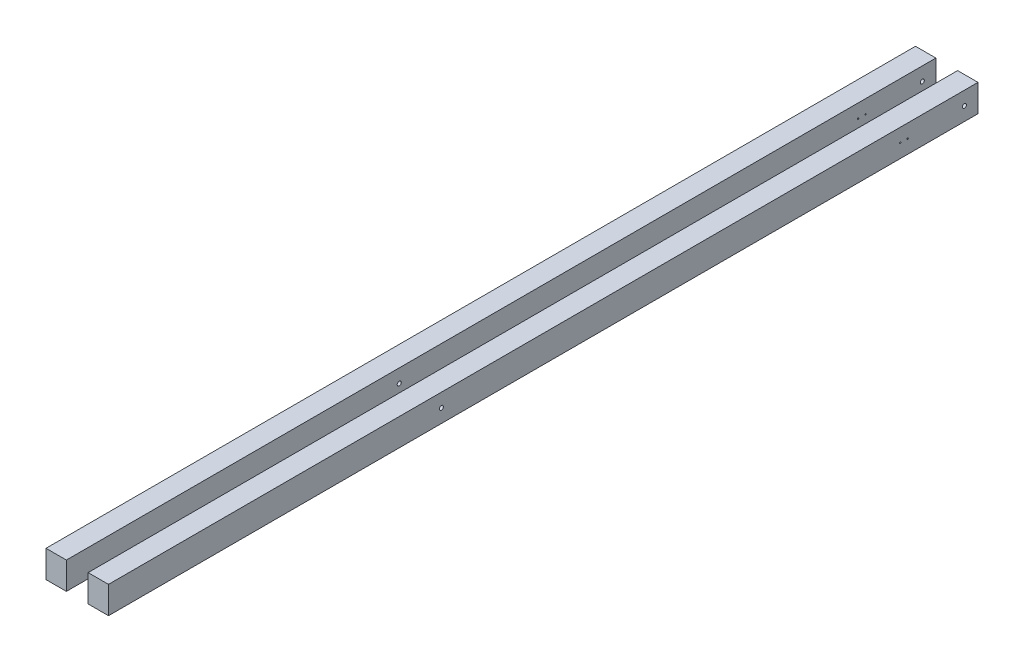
ISO-10303-21;
HEADER;
FILE_DESCRIPTION(('STEP AP214'),'2;1');
FILE_NAME('part.step','',(''),(''),'','','');
FILE_SCHEMA(('AUTOMOTIVE_DESIGN { 1 0 10303 214 1 1 1 1 }'));
ENDSEC;
DATA;
#1=APPLICATION_CONTEXT('core data for automotive mechanical design processes');
#2=APPLICATION_PROTOCOL_DEFINITION('international standard','automotive_design',2000,#1);
#3=PRODUCT_CONTEXT('',#1,'mechanical');
#4=PRODUCT('Part','Part','',(#3));
#5=PRODUCT_RELATED_PRODUCT_CATEGORY('part','',(#4));
#6=PRODUCT_DEFINITION_FORMATION('','',#4);
#7=PRODUCT_DEFINITION_CONTEXT('part definition',#1,'design');
#8=PRODUCT_DEFINITION('design','',#6,#7);
#9=PRODUCT_DEFINITION_SHAPE('','',#8);
#10=(LENGTH_UNIT() NAMED_UNIT(*) SI_UNIT(.MILLI.,.METRE.));
#11=(NAMED_UNIT(*) PLANE_ANGLE_UNIT() SI_UNIT($,.RADIAN.));
#12=(NAMED_UNIT(*) SI_UNIT($,.STERADIAN.) SOLID_ANGLE_UNIT());
#13=UNCERTAINTY_MEASURE_WITH_UNIT(LENGTH_MEASURE(1.E-05),#10,'distance_accuracy_value','');
#14=(GEOMETRIC_REPRESENTATION_CONTEXT(3) GLOBAL_UNCERTAINTY_ASSIGNED_CONTEXT((#13)) GLOBAL_UNIT_ASSIGNED_CONTEXT((#10,
#11,#12)) REPRESENTATION_CONTEXT('',''));
#15=CARTESIAN_POINT('',(0.,0.,0.));
#16=DIRECTION('',(0.,0.,1.));
#17=DIRECTION('',(1.,0.,0.));
#18=AXIS2_PLACEMENT_3D('',#15,#16,#17);
#19=CARTESIAN_POINT('',(16.,-20.,1280.));
#20=DIRECTION('',(1.,0.,0.));
#21=DIRECTION('',(0.,0.,-1.));
#22=AXIS2_PLACEMENT_3D('',#19,#20,#21);
#23=PLANE('',#22);
#24=CARTESIAN_POINT('',(16.,0.,790.));
#25=DIRECTION('',(1.,0.,0.));
#26=DIRECTION('',(0.,0.,-1.));
#27=AXIS2_PLACEMENT_3D('',#24,#25,#26);
#28=CIRCLE('',#27,3.00000000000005);
#29=CARTESIAN_POINT('',(16.,0.,787.));
#30=VERTEX_POINT('',#29);
#31=EDGE_CURVE('E109',#30,#30,#28,.T.);
#32=ORIENTED_EDGE('',*,*,#31,.T.);
#33=EDGE_LOOP('',(#32));
#34=FACE_BOUND('',#33,.T.);
#35=CARTESIAN_POINT('',(16.,0.,20.));
#36=DIRECTION('',(1.,0.,0.));
#37=DIRECTION('',(0.,0.,-1.));
#38=AXIS2_PLACEMENT_3D('',#35,#36,#37);
#39=CIRCLE('',#38,3.);
#40=CARTESIAN_POINT('',(16.,0.,17.));
#41=VERTEX_POINT('',#40);
#42=EDGE_CURVE('E122',#41,#41,#39,.T.);
#43=ORIENTED_EDGE('',*,*,#42,.T.);
#44=EDGE_LOOP('',(#43));
#45=FACE_BOUND('',#44,.T.);
#46=CARTESIAN_POINT('',(16.,0.,114.397647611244));
#47=DIRECTION('',(1.,0.,0.));
#48=DIRECTION('',(0.,0.,-1.));
#49=AXIS2_PLACEMENT_3D('',#46,#47,#48);
#50=CIRCLE('',#49,0.999999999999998);
#51=CARTESIAN_POINT('',(16.,0.,113.397647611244));
#52=VERTEX_POINT('',#51);
#53=EDGE_CURVE('E125',#52,#52,#50,.T.);
#54=ORIENTED_EDGE('',*,*,#53,.T.);
#55=EDGE_LOOP('',(#54));
#56=FACE_BOUND('',#55,.T.);
#57=CARTESIAN_POINT('',(16.,0.,103.592173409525));
#58=DIRECTION('',(1.,0.,0.));
#59=DIRECTION('',(0.,0.,-1.));
#60=AXIS2_PLACEMENT_3D('',#57,#58,#59);
#61=CIRCLE('',#60,0.999999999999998);
#62=CARTESIAN_POINT('',(16.,0.,102.592173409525));
#63=VERTEX_POINT('',#62);
#64=EDGE_CURVE('E128',#63,#63,#61,.T.);
#65=ORIENTED_EDGE('',*,*,#64,.T.);
#66=EDGE_LOOP('',(#65));
#67=FACE_BOUND('',#66,.T.);
#68=DIRECTION('',(0.,-1.,0.));
#69=VECTOR('',#68,1.);
#70=CARTESIAN_POINT('',(16.,-20.,0.));
#71=LINE('',#70,#69);
#72=CARTESIAN_POINT('',(16.,20.,0.));
#73=VERTEX_POINT('',#72);
#74=CARTESIAN_POINT('',(16.,-20.,0.));
#75=VERTEX_POINT('',#74);
#76=EDGE_CURVE('E106',#73,#75,#71,.T.);
#77=ORIENTED_EDGE('',*,*,#76,.T.);
#78=DIRECTION('',(0.,0.,-1.));
#79=VECTOR('',#78,1.);
#80=CARTESIAN_POINT('',(16.,-20.,1280.));
#81=LINE('',#80,#79);
#82=CARTESIAN_POINT('',(16.,-20.,1280.));
#83=VERTEX_POINT('',#82);
#84=EDGE_CURVE('E12',#83,#75,#81,.T.);
#85=ORIENTED_EDGE('',*,*,#84,.F.);
#86=DIRECTION('',(0.,-1.,0.));
#87=VECTOR('',#86,1.);
#88=CARTESIAN_POINT('',(16.,-20.,1280.));
#89=LINE('',#88,#87);
#90=CARTESIAN_POINT('',(16.,20.,1280.));
#91=VERTEX_POINT('',#90);
#92=EDGE_CURVE('E94',#91,#83,#89,.T.);
#93=ORIENTED_EDGE('',*,*,#92,.F.);
#94=DIRECTION('',(0.,0.,-1.));
#95=VECTOR('',#94,1.);
#96=CARTESIAN_POINT('',(16.,20.,1280.));
#97=LINE('',#96,#95);
#98=EDGE_CURVE('E102',#91,#73,#97,.T.);
#99=ORIENTED_EDGE('',*,*,#98,.T.);
#100=EDGE_LOOP('',(#77,#85,#93,#99));
#101=FACE_BOUND('',#100,.T.);
#102=ADVANCED_FACE('F43',(#34,#45,#56,#67,#101),#23,.F.);
#103=CARTESIAN_POINT('',(46.,-20.,1280.));
#104=DIRECTION('',(0.,1.,0.));
#105=DIRECTION('',(-1.,0.,0.));
#106=AXIS2_PLACEMENT_3D('',#103,#104,#105);
#107=PLANE('',#106);
#108=DIRECTION('',(1.,0.,0.));
#109=VECTOR('',#108,1.);
#110=CARTESIAN_POINT('',(46.,-20.,0.));
#111=LINE('',#110,#109);
#112=CARTESIAN_POINT('',(46.,-20.,0.));
#113=VERTEX_POINT('',#112);
#114=EDGE_CURVE('E98',#75,#113,#111,.T.);
#115=ORIENTED_EDGE('',*,*,#114,.T.);
#116=DIRECTION('',(0.,0.,-1.));
#117=VECTOR('',#116,1.);
#118=CARTESIAN_POINT('',(46.,-20.,1280.));
#119=LINE('',#118,#117);
#120=CARTESIAN_POINT('',(46.,-20.,1280.));
#121=VERTEX_POINT('',#120);
#122=EDGE_CURVE('E51',#121,#113,#119,.T.);
#123=ORIENTED_EDGE('',*,*,#122,.F.);
#124=DIRECTION('',(1.,0.,0.));
#125=VECTOR('',#124,1.);
#126=CARTESIAN_POINT('',(46.,-20.,1280.));
#127=LINE('',#126,#125);
#128=EDGE_CURVE('E89',#83,#121,#127,.T.);
#129=ORIENTED_EDGE('',*,*,#128,.F.);
#130=ORIENTED_EDGE('',*,*,#84,.T.);
#131=EDGE_LOOP('',(#115,#123,#129,#130));
#132=FACE_BOUND('',#131,.T.);
#133=ADVANCED_FACE('F97',(#132),#107,.F.);
#134=CARTESIAN_POINT('',(46.,-20.,1280.));
#135=DIRECTION('',(-1.,0.,0.));
#136=DIRECTION('',(0.,0.,1.));
#137=AXIS2_PLACEMENT_3D('',#134,#135,#136);
#138=PLANE('',#137);
#139=CARTESIAN_POINT('',(46.,0.,790.));
#140=DIRECTION('',(1.,0.,0.));
#141=DIRECTION('',(0.,0.,-1.));
#142=AXIS2_PLACEMENT_3D('',#139,#140,#141);
#143=CIRCLE('',#142,3.00000000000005);
#144=CARTESIAN_POINT('',(46.,0.,787.));
#145=VERTEX_POINT('',#144);
#146=EDGE_CURVE('E131',#145,#145,#143,.T.);
#147=ORIENTED_EDGE('',*,*,#146,.F.);
#148=EDGE_LOOP('',(#147));
#149=FACE_BOUND('',#148,.T.);
#150=CARTESIAN_POINT('',(46.,0.,20.));
#151=DIRECTION('',(1.,0.,0.));
#152=DIRECTION('',(0.,0.,-1.));
#153=AXIS2_PLACEMENT_3D('',#150,#151,#152);
#154=CIRCLE('',#153,3.);
#155=CARTESIAN_POINT('',(46.,0.,17.));
#156=VERTEX_POINT('',#155);
#157=EDGE_CURVE('E138',#156,#156,#154,.T.);
#158=ORIENTED_EDGE('',*,*,#157,.F.);
#159=EDGE_LOOP('',(#158));
#160=FACE_BOUND('',#159,.T.);
#161=CARTESIAN_POINT('',(46.,0.,114.397647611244));
#162=DIRECTION('',(1.,0.,0.));
#163=DIRECTION('',(0.,0.,-1.));
#164=AXIS2_PLACEMENT_3D('',#161,#162,#163);
#165=CIRCLE('',#164,0.999999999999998);
#166=CARTESIAN_POINT('',(46.,0.,113.397647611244));
#167=VERTEX_POINT('',#166);
#168=EDGE_CURVE('E135',#167,#167,#165,.T.);
#169=ORIENTED_EDGE('',*,*,#168,.F.);
#170=EDGE_LOOP('',(#169));
#171=FACE_BOUND('',#170,.T.);
#172=CARTESIAN_POINT('',(46.,0.,103.592173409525));
#173=DIRECTION('',(1.,0.,0.));
#174=DIRECTION('',(0.,0.,-1.));
#175=AXIS2_PLACEMENT_3D('',#172,#173,#174);
#176=CIRCLE('',#175,0.999999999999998);
#177=CARTESIAN_POINT('',(46.,0.,102.592173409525));
#178=VERTEX_POINT('',#177);
#179=EDGE_CURVE('E132',#178,#178,#176,.T.);
#180=ORIENTED_EDGE('',*,*,#179,.F.);
#181=EDGE_LOOP('',(#180));
#182=FACE_BOUND('',#181,.T.);
#183=DIRECTION('',(0.,1.,0.));
#184=VECTOR('',#183,1.);
#185=CARTESIAN_POINT('',(46.,-20.,0.));
#186=LINE('',#185,#184);
#187=CARTESIAN_POINT('',(46.,20.,0.));
#188=VERTEX_POINT('',#187);
#189=EDGE_CURVE('E76',#113,#188,#186,.T.);
#190=ORIENTED_EDGE('',*,*,#189,.T.);
#191=DIRECTION('',(0.,0.,-1.));
#192=VECTOR('',#191,1.);
#193=CARTESIAN_POINT('',(46.,20.,1280.));
#194=LINE('',#193,#192);
#195=CARTESIAN_POINT('',(46.,20.,1280.));
#196=VERTEX_POINT('',#195);
#197=EDGE_CURVE('E99',#196,#188,#194,.T.);
#198=ORIENTED_EDGE('',*,*,#197,.F.);
#199=DIRECTION('',(0.,1.,0.));
#200=VECTOR('',#199,1.);
#201=CARTESIAN_POINT('',(46.,-20.,1280.));
#202=LINE('',#201,#200);
#203=EDGE_CURVE('E92',#121,#196,#202,.T.);
#204=ORIENTED_EDGE('',*,*,#203,.F.);
#205=ORIENTED_EDGE('',*,*,#122,.T.);
#206=EDGE_LOOP('',(#190,#198,#204,#205));
#207=FACE_BOUND('',#206,.T.);
#208=ADVANCED_FACE('F100',(#149,#160,#171,#182,#207),#138,.F.);
#209=CARTESIAN_POINT('',(46.,20.,1280.));
#210=DIRECTION('',(0.,-1.,0.));
#211=DIRECTION('',(1.,0.,0.));
#212=AXIS2_PLACEMENT_3D('',#209,#210,#211);
#213=PLANE('',#212);
#214=DIRECTION('',(-1.,0.,0.));
#215=VECTOR('',#214,1.);
#216=CARTESIAN_POINT('',(46.,20.,0.));
#217=LINE('',#216,#215);
#218=EDGE_CURVE('E82',#188,#73,#217,.T.);
#219=ORIENTED_EDGE('',*,*,#218,.T.);
#220=ORIENTED_EDGE('',*,*,#98,.F.);
#221=DIRECTION('',(-1.,0.,0.));
#222=VECTOR('',#221,1.);
#223=CARTESIAN_POINT('',(46.,20.,1280.));
#224=LINE('',#223,#222);
#225=EDGE_CURVE('E59',#196,#91,#224,.T.);
#226=ORIENTED_EDGE('',*,*,#225,.F.);
#227=ORIENTED_EDGE('',*,*,#197,.T.);
#228=EDGE_LOOP('',(#219,#220,#226,#227));
#229=FACE_BOUND('',#228,.T.);
#230=ADVANCED_FACE('F114',(#229),#213,.F.);
#231=CARTESIAN_POINT('',(0.,0.,1280.));
#232=DIRECTION('',(0.,0.,1.));
#233=DIRECTION('',(1.,0.,0.));
#234=AXIS2_PLACEMENT_3D('',#231,#232,#233);
#235=PLANE('',#234);
#236=ORIENTED_EDGE('',*,*,#92,.T.);
#237=ORIENTED_EDGE('',*,*,#128,.T.);
#238=ORIENTED_EDGE('',*,*,#203,.T.);
#239=ORIENTED_EDGE('',*,*,#225,.T.);
#240=EDGE_LOOP('',(#236,#237,#238,#239));
#241=FACE_BOUND('',#240,.T.);
#242=ADVANCED_FACE('F90',(#241),#235,.T.);
#243=CARTESIAN_POINT('',(0.,0.,0.));
#244=DIRECTION('',(0.,0.,1.));
#245=DIRECTION('',(1.,0.,0.));
#246=AXIS2_PLACEMENT_3D('',#243,#244,#245);
#247=PLANE('',#246);
#248=ORIENTED_EDGE('',*,*,#76,.F.);
#249=ORIENTED_EDGE('',*,*,#218,.F.);
#250=ORIENTED_EDGE('',*,*,#189,.F.);
#251=ORIENTED_EDGE('',*,*,#114,.F.);
#252=EDGE_LOOP('',(#248,#249,#250,#251));
#253=FACE_BOUND('',#252,.T.);
#254=ADVANCED_FACE('F117',(#253),#247,.F.);
#255=CARTESIAN_POINT('',(-46.,0.,103.592173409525));
#256=DIRECTION('',(1.,0.,0.));
#257=DIRECTION('',(0.,0.,-1.));
#258=AXIS2_PLACEMENT_3D('',#255,#256,#257);
#259=CYLINDRICAL_SURFACE('',#258,0.999999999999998);
#260=ORIENTED_EDGE('',*,*,#179,.T.);
#261=EDGE_LOOP('',(#260));
#262=FACE_BOUND('',#261,.T.);
#263=ORIENTED_EDGE('',*,*,#64,.F.);
#264=EDGE_LOOP('',(#263));
#265=FACE_BOUND('',#264,.T.);
#266=ADVANCED_FACE('F156',(#262,#265),#259,.F.);
#267=CARTESIAN_POINT('',(-46.,0.,114.397647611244));
#268=DIRECTION('',(1.,0.,0.));
#269=DIRECTION('',(0.,0.,-1.));
#270=AXIS2_PLACEMENT_3D('',#267,#268,#269);
#271=CYLINDRICAL_SURFACE('',#270,0.999999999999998);
#272=ORIENTED_EDGE('',*,*,#168,.T.);
#273=EDGE_LOOP('',(#272));
#274=FACE_BOUND('',#273,.T.);
#275=ORIENTED_EDGE('',*,*,#53,.F.);
#276=EDGE_LOOP('',(#275));
#277=FACE_BOUND('',#276,.T.);
#278=ADVANCED_FACE('F159',(#274,#277),#271,.F.);
#279=CARTESIAN_POINT('',(-46.,0.,20.));
#280=DIRECTION('',(1.,0.,0.));
#281=DIRECTION('',(0.,0.,-1.));
#282=AXIS2_PLACEMENT_3D('',#279,#280,#281);
#283=CYLINDRICAL_SURFACE('',#282,3.);
#284=ORIENTED_EDGE('',*,*,#157,.T.);
#285=EDGE_LOOP('',(#284));
#286=FACE_BOUND('',#285,.T.);
#287=ORIENTED_EDGE('',*,*,#42,.F.);
#288=EDGE_LOOP('',(#287));
#289=FACE_BOUND('',#288,.T.);
#290=ADVANCED_FACE('F175',(#286,#289),#283,.F.);
#291=CARTESIAN_POINT('',(-46.,0.,790.));
#292=DIRECTION('',(1.,0.,0.));
#293=DIRECTION('',(0.,0.,-1.));
#294=AXIS2_PLACEMENT_3D('',#291,#292,#293);
#295=CYLINDRICAL_SURFACE('',#294,3.00000000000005);
#296=ORIENTED_EDGE('',*,*,#146,.T.);
#297=EDGE_LOOP('',(#296));
#298=FACE_BOUND('',#297,.T.);
#299=ORIENTED_EDGE('',*,*,#31,.F.);
#300=EDGE_LOOP('',(#299));
#301=FACE_BOUND('',#300,.T.);
#302=ADVANCED_FACE('F144',(#298,#301),#295,.F.);
#303=CLOSED_SHELL('',(#102,#133,#208,#230,#242,#254,#266,#278,#290,#302));
#304=MANIFOLD_SOLID_BREP('B2',#303);
#305=CARTESIAN_POINT('',(-46.,-20.,1280.));
#306=DIRECTION('',(1.,0.,0.));
#307=DIRECTION('',(0.,0.,-1.));
#308=AXIS2_PLACEMENT_3D('',#305,#306,#307);
#309=PLANE('',#308);
#310=CARTESIAN_POINT('',(-46.,0.,790.));
#311=DIRECTION('',(1.,0.,0.));
#312=DIRECTION('',(0.,0.,-1.));
#313=AXIS2_PLACEMENT_3D('',#310,#311,#312);
#314=CIRCLE('',#313,3.00000000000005);
#315=CARTESIAN_POINT('',(-46.,0.,787.));
#316=VERTEX_POINT('',#315);
#317=EDGE_CURVE('E329',#316,#316,#314,.T.);
#318=ORIENTED_EDGE('',*,*,#317,.T.);
#319=EDGE_LOOP('',(#318));
#320=FACE_BOUND('',#319,.T.);
#321=CARTESIAN_POINT('',(-46.,0.,20.));
#322=DIRECTION('',(1.,0.,0.));
#323=DIRECTION('',(0.,0.,-1.));
#324=AXIS2_PLACEMENT_3D('',#321,#322,#323);
#325=CIRCLE('',#324,3.);
#326=CARTESIAN_POINT('',(-46.,0.,17.));
#327=VERTEX_POINT('',#326);
#328=EDGE_CURVE('E361',#327,#327,#325,.T.);
#329=ORIENTED_EDGE('',*,*,#328,.T.);
#330=EDGE_LOOP('',(#329));
#331=FACE_BOUND('',#330,.T.);
#332=CARTESIAN_POINT('',(-46.,0.,114.397647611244));
#333=DIRECTION('',(1.,0.,0.));
#334=DIRECTION('',(0.,0.,-1.));
#335=AXIS2_PLACEMENT_3D('',#332,#333,#334);
#336=CIRCLE('',#335,0.999999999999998);
#337=CARTESIAN_POINT('',(-46.,0.,113.397647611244));
#338=VERTEX_POINT('',#337);
#339=EDGE_CURVE('E365',#338,#338,#336,.T.);
#340=ORIENTED_EDGE('',*,*,#339,.T.);
#341=EDGE_LOOP('',(#340));
#342=FACE_BOUND('',#341,.T.);
#343=CARTESIAN_POINT('',(-46.,0.,103.592173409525));
#344=DIRECTION('',(1.,0.,0.));
#345=DIRECTION('',(0.,0.,-1.));
#346=AXIS2_PLACEMENT_3D('',#343,#344,#345);
#347=CIRCLE('',#346,0.999999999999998);
#348=CARTESIAN_POINT('',(-46.,0.,102.592173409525));
#349=VERTEX_POINT('',#348);
#350=EDGE_CURVE('E369',#349,#349,#347,.T.);
#351=ORIENTED_EDGE('',*,*,#350,.T.);
#352=EDGE_LOOP('',(#351));
#353=FACE_BOUND('',#352,.T.);
#354=DIRECTION('',(0.,-1.,0.));
#355=VECTOR('',#354,1.);
#356=CARTESIAN_POINT('',(-46.,-20.,0.));
#357=LINE('',#356,#355);
#358=CARTESIAN_POINT('',(-46.,20.,0.));
#359=VERTEX_POINT('',#358);
#360=CARTESIAN_POINT('',(-46.,-20.,0.));
#361=VERTEX_POINT('',#360);
#362=EDGE_CURVE('E317',#359,#361,#357,.T.);
#363=ORIENTED_EDGE('',*,*,#362,.T.);
#364=DIRECTION('',(0.,0.,-1.));
#365=VECTOR('',#364,1.);
#366=CARTESIAN_POINT('',(-46.,-20.,1280.));
#367=LINE('',#366,#365);
#368=CARTESIAN_POINT('',(-46.,-20.,1280.));
#369=VERTEX_POINT('',#368);
#370=EDGE_CURVE('E41',#369,#361,#367,.T.);
#371=ORIENTED_EDGE('',*,*,#370,.F.);
#372=DIRECTION('',(0.,-1.,0.));
#373=VECTOR('',#372,1.);
#374=CARTESIAN_POINT('',(-46.,-20.,1280.));
#375=LINE('',#374,#373);
#376=CARTESIAN_POINT('',(-46.,20.,1280.));
#377=VERTEX_POINT('',#376);
#378=EDGE_CURVE('E304',#377,#369,#375,.T.);
#379=ORIENTED_EDGE('',*,*,#378,.F.);
#380=DIRECTION('',(0.,0.,-1.));
#381=VECTOR('',#380,1.);
#382=CARTESIAN_POINT('',(-46.,20.,1280.));
#383=LINE('',#382,#381);
#384=EDGE_CURVE('E313',#377,#359,#383,.T.);
#385=ORIENTED_EDGE('',*,*,#384,.T.);
#386=EDGE_LOOP('',(#363,#371,#379,#385));
#387=FACE_BOUND('',#386,.T.);
#388=ADVANCED_FACE('F251',(#320,#331,#342,#353,#387),#309,.F.);
#389=CARTESIAN_POINT('',(-16.,-20.,1280.));
#390=DIRECTION('',(0.,1.,0.));
#391=DIRECTION('',(-1.,0.,0.));
#392=AXIS2_PLACEMENT_3D('',#389,#390,#391);
#393=PLANE('',#392);
#394=DIRECTION('',(1.,0.,0.));
#395=VECTOR('',#394,1.);
#396=CARTESIAN_POINT('',(-16.,-20.,0.));
#397=LINE('',#396,#395);
#398=CARTESIAN_POINT('',(-16.,-20.,0.));
#399=VERTEX_POINT('',#398);
#400=EDGE_CURVE('E308',#361,#399,#397,.T.);
#401=ORIENTED_EDGE('',*,*,#400,.T.);
#402=DIRECTION('',(0.,0.,-1.));
#403=VECTOR('',#402,1.);
#404=CARTESIAN_POINT('',(-16.,-20.,1280.));
#405=LINE('',#404,#403);
#406=CARTESIAN_POINT('',(-16.,-20.,1280.));
#407=VERTEX_POINT('',#406);
#408=EDGE_CURVE('E260',#407,#399,#405,.T.);
#409=ORIENTED_EDGE('',*,*,#408,.F.);
#410=DIRECTION('',(1.,0.,0.));
#411=VECTOR('',#410,1.);
#412=CARTESIAN_POINT('',(-16.,-20.,1280.));
#413=LINE('',#412,#411);
#414=EDGE_CURVE('E299',#369,#407,#413,.T.);
#415=ORIENTED_EDGE('',*,*,#414,.F.);
#416=ORIENTED_EDGE('',*,*,#370,.T.);
#417=EDGE_LOOP('',(#401,#409,#415,#416));
#418=FACE_BOUND('',#417,.T.);
#419=ADVANCED_FACE('F307',(#418),#393,.F.);
#420=CARTESIAN_POINT('',(-16.,-20.,1280.));
#421=DIRECTION('',(-1.,0.,0.));
#422=DIRECTION('',(0.,0.,1.));
#423=AXIS2_PLACEMENT_3D('',#420,#421,#422);
#424=PLANE('',#423);
#425=CARTESIAN_POINT('',(-16.,0.,790.));
#426=DIRECTION('',(-1.,0.,0.));
#427=DIRECTION('',(0.,0.,1.));
#428=AXIS2_PLACEMENT_3D('',#425,#426,#427);
#429=CIRCLE('',#428,3.00000000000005);
#430=CARTESIAN_POINT('',(-16.,0.,793.));
#431=VERTEX_POINT('',#430);
#432=EDGE_CURVE('E254',#431,#431,#429,.T.);
#433=ORIENTED_EDGE('',*,*,#432,.T.);
#434=EDGE_LOOP('',(#433));
#435=FACE_BOUND('',#434,.T.);
#436=CARTESIAN_POINT('',(-16.,0.,20.));
#437=DIRECTION('',(-1.,0.,0.));
#438=DIRECTION('',(0.,0.,1.));
#439=AXIS2_PLACEMENT_3D('',#436,#437,#438);
#440=CIRCLE('',#439,3.);
#441=CARTESIAN_POINT('',(-16.,0.,23.));
#442=VERTEX_POINT('',#441);
#443=EDGE_CURVE('E331',#442,#442,#440,.T.);
#444=ORIENTED_EDGE('',*,*,#443,.T.);
#445=EDGE_LOOP('',(#444));
#446=FACE_BOUND('',#445,.T.);
#447=CARTESIAN_POINT('',(-16.,0.,114.397647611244));
#448=DIRECTION('',(-1.,0.,0.));
#449=DIRECTION('',(0.,0.,1.));
#450=AXIS2_PLACEMENT_3D('',#447,#448,#449);
#451=CIRCLE('',#450,0.999999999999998);
#452=CARTESIAN_POINT('',(-16.,0.,115.397647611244));
#453=VERTEX_POINT('',#452);
#454=EDGE_CURVE('E328',#453,#453,#451,.T.);
#455=ORIENTED_EDGE('',*,*,#454,.T.);
#456=EDGE_LOOP('',(#455));
#457=FACE_BOUND('',#456,.T.);
#458=CARTESIAN_POINT('',(-16.,0.,103.592173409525));
#459=DIRECTION('',(-1.,0.,0.));
#460=DIRECTION('',(0.,0.,1.));
#461=AXIS2_PLACEMENT_3D('',#458,#459,#460);
#462=CIRCLE('',#461,0.999999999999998);
#463=CARTESIAN_POINT('',(-16.,0.,104.592173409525));
#464=VERTEX_POINT('',#463);
#465=EDGE_CURVE('E325',#464,#464,#462,.T.);
#466=ORIENTED_EDGE('',*,*,#465,.T.);
#467=EDGE_LOOP('',(#466));
#468=FACE_BOUND('',#467,.T.);
#469=DIRECTION('',(0.,1.,0.));
#470=VECTOR('',#469,1.);
#471=CARTESIAN_POINT('',(-16.,-20.,0.));
#472=LINE('',#471,#470);
#473=CARTESIAN_POINT('',(-16.,20.,0.));
#474=VERTEX_POINT('',#473);
#475=EDGE_CURVE('E286',#399,#474,#472,.T.);
#476=ORIENTED_EDGE('',*,*,#475,.T.);
#477=DIRECTION('',(0.,0.,-1.));
#478=VECTOR('',#477,1.);
#479=CARTESIAN_POINT('',(-16.,20.,1280.));
#480=LINE('',#479,#478);
#481=CARTESIAN_POINT('',(-16.,20.,1280.));
#482=VERTEX_POINT('',#481);
#483=EDGE_CURVE('E309',#482,#474,#480,.T.);
#484=ORIENTED_EDGE('',*,*,#483,.F.);
#485=DIRECTION('',(0.,1.,0.));
#486=VECTOR('',#485,1.);
#487=CARTESIAN_POINT('',(-16.,-20.,1280.));
#488=LINE('',#487,#486);
#489=EDGE_CURVE('E302',#407,#482,#488,.T.);
#490=ORIENTED_EDGE('',*,*,#489,.F.);
#491=ORIENTED_EDGE('',*,*,#408,.T.);
#492=EDGE_LOOP('',(#476,#484,#490,#491));
#493=FACE_BOUND('',#492,.T.);
#494=ADVANCED_FACE('F311',(#435,#446,#457,#468,#493),#424,.F.);
#495=CARTESIAN_POINT('',(-16.,20.,1280.));
#496=DIRECTION('',(0.,-1.,0.));
#497=DIRECTION('',(1.,0.,0.));
#498=AXIS2_PLACEMENT_3D('',#495,#496,#497);
#499=PLANE('',#498);
#500=DIRECTION('',(-1.,0.,0.));
#501=VECTOR('',#500,1.);
#502=CARTESIAN_POINT('',(-16.,20.,0.));
#503=LINE('',#502,#501);
#504=EDGE_CURVE('E292',#474,#359,#503,.T.);
#505=ORIENTED_EDGE('',*,*,#504,.T.);
#506=ORIENTED_EDGE('',*,*,#384,.F.);
#507=DIRECTION('',(-1.,0.,0.));
#508=VECTOR('',#507,1.);
#509=CARTESIAN_POINT('',(-16.,20.,1280.));
#510=LINE('',#509,#508);
#511=EDGE_CURVE('E269',#482,#377,#510,.T.);
#512=ORIENTED_EDGE('',*,*,#511,.F.);
#513=ORIENTED_EDGE('',*,*,#483,.T.);
#514=EDGE_LOOP('',(#505,#506,#512,#513));
#515=FACE_BOUND('',#514,.T.);
#516=ADVANCED_FACE('F382',(#515),#499,.F.);
#517=CARTESIAN_POINT('',(0.,0.,1280.));
#518=DIRECTION('',(0.,0.,1.));
#519=DIRECTION('',(1.,0.,0.));
#520=AXIS2_PLACEMENT_3D('',#517,#518,#519);
#521=PLANE('',#520);
#522=ORIENTED_EDGE('',*,*,#378,.T.);
#523=ORIENTED_EDGE('',*,*,#414,.T.);
#524=ORIENTED_EDGE('',*,*,#489,.T.);
#525=ORIENTED_EDGE('',*,*,#511,.T.);
#526=EDGE_LOOP('',(#522,#523,#524,#525));
#527=FACE_BOUND('',#526,.T.);
#528=ADVANCED_FACE('F300',(#527),#521,.T.);
#529=CARTESIAN_POINT('',(0.,0.,0.));
#530=DIRECTION('',(0.,0.,1.));
#531=DIRECTION('',(1.,0.,0.));
#532=AXIS2_PLACEMENT_3D('',#529,#530,#531);
#533=PLANE('',#532);
#534=ORIENTED_EDGE('',*,*,#362,.F.);
#535=ORIENTED_EDGE('',*,*,#504,.F.);
#536=ORIENTED_EDGE('',*,*,#475,.F.);
#537=ORIENTED_EDGE('',*,*,#400,.F.);
#538=EDGE_LOOP('',(#534,#535,#536,#537));
#539=FACE_BOUND('',#538,.T.);
#540=ADVANCED_FACE('F372',(#539),#533,.F.);
#541=CARTESIAN_POINT('',(-46.,0.,103.592173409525));
#542=DIRECTION('',(1.,0.,0.));
#543=DIRECTION('',(0.,0.,-1.));
#544=AXIS2_PLACEMENT_3D('',#541,#542,#543);
#545=CYLINDRICAL_SURFACE('',#544,0.999999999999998);
#546=ORIENTED_EDGE('',*,*,#350,.F.);
#547=EDGE_LOOP('',(#546));
#548=FACE_BOUND('',#547,.T.);
#549=ORIENTED_EDGE('',*,*,#465,.F.);
#550=EDGE_LOOP('',(#549));
#551=FACE_BOUND('',#550,.T.);
#552=ADVANCED_FACE('F374',(#548,#551),#545,.F.);
#553=CARTESIAN_POINT('',(-46.,0.,114.397647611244));
#554=DIRECTION('',(1.,0.,0.));
#555=DIRECTION('',(0.,0.,-1.));
#556=AXIS2_PLACEMENT_3D('',#553,#554,#555);
#557=CYLINDRICAL_SURFACE('',#556,0.999999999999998);
#558=ORIENTED_EDGE('',*,*,#339,.F.);
#559=EDGE_LOOP('',(#558));
#560=FACE_BOUND('',#559,.T.);
#561=ORIENTED_EDGE('',*,*,#454,.F.);
#562=EDGE_LOOP('',(#561));
#563=FACE_BOUND('',#562,.T.);
#564=ADVANCED_FACE('F347',(#560,#563),#557,.F.);
#565=CARTESIAN_POINT('',(-46.,0.,20.));
#566=DIRECTION('',(1.,0.,0.));
#567=DIRECTION('',(0.,0.,-1.));
#568=AXIS2_PLACEMENT_3D('',#565,#566,#567);
#569=CYLINDRICAL_SURFACE('',#568,3.);
#570=ORIENTED_EDGE('',*,*,#328,.F.);
#571=EDGE_LOOP('',(#570));
#572=FACE_BOUND('',#571,.T.);
#573=ORIENTED_EDGE('',*,*,#443,.F.);
#574=EDGE_LOOP('',(#573));
#575=FACE_BOUND('',#574,.T.);
#576=ADVANCED_FACE('F341',(#572,#575),#569,.F.);
#577=CARTESIAN_POINT('',(-46.,0.,790.));
#578=DIRECTION('',(1.,0.,0.));
#579=DIRECTION('',(0.,0.,-1.));
#580=AXIS2_PLACEMENT_3D('',#577,#578,#579);
#581=CYLINDRICAL_SURFACE('',#580,3.00000000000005);
#582=ORIENTED_EDGE('',*,*,#317,.F.);
#583=EDGE_LOOP('',(#582));
#584=FACE_BOUND('',#583,.T.);
#585=ORIENTED_EDGE('',*,*,#432,.F.);
#586=EDGE_LOOP('',(#585));
#587=FACE_BOUND('',#586,.T.);
#588=ADVANCED_FACE('F339',(#584,#587),#581,.F.);
#589=CLOSED_SHELL('',(#388,#419,#494,#516,#528,#540,#552,#564,#576,#588));
#590=MANIFOLD_SOLID_BREP('B6',#589);
#591=ADVANCED_BREP_SHAPE_REPRESENTATION('',(#18,#304,#590),#14);
#592=SHAPE_DEFINITION_REPRESENTATION(#9,#591);
ENDSEC;
END-ISO-10303-21;
